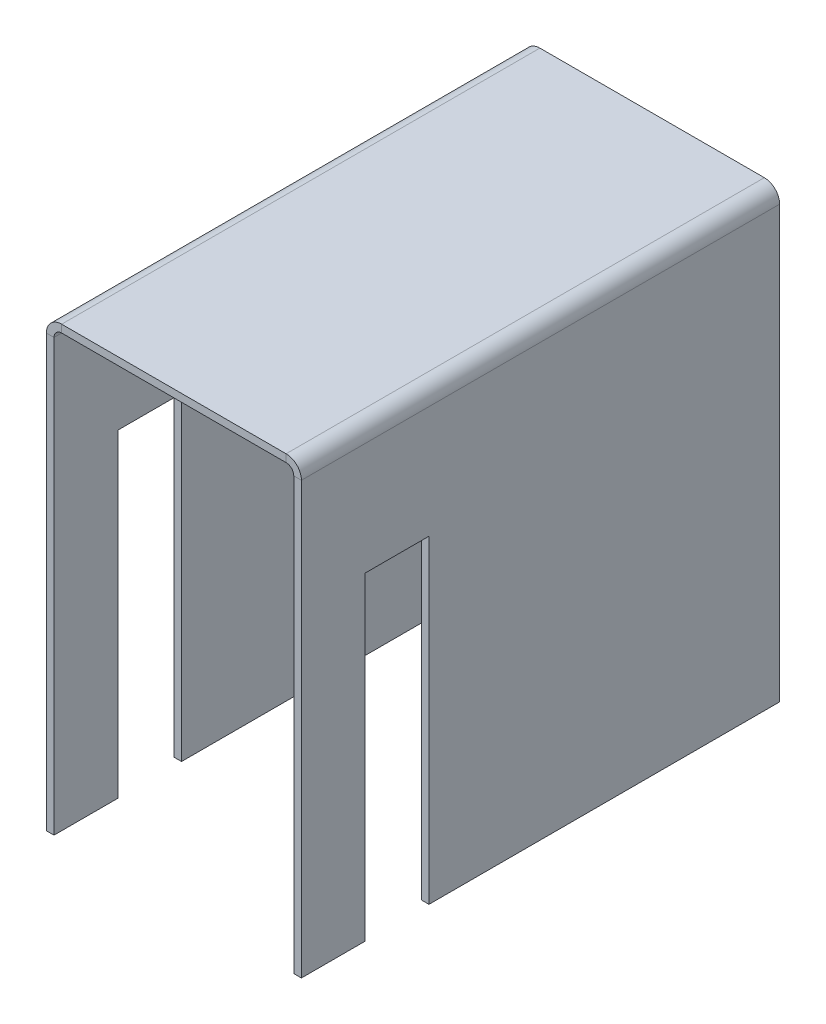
ISO-10303-21;
HEADER;
FILE_DESCRIPTION(('STEP AP214'),'2;1');
FILE_NAME('part.step','',(''),(''),'','','');
FILE_SCHEMA(('AUTOMOTIVE_DESIGN { 1 0 10303 214 1 1 1 1 }'));
ENDSEC;
DATA;
#1=APPLICATION_CONTEXT('core data for automotive mechanical design processes');
#2=APPLICATION_PROTOCOL_DEFINITION('international standard','automotive_design',2000,#1);
#3=PRODUCT_CONTEXT('',#1,'mechanical');
#4=PRODUCT('Part','Part','',(#3));
#5=PRODUCT_RELATED_PRODUCT_CATEGORY('part','',(#4));
#6=PRODUCT_DEFINITION_FORMATION('','',#4);
#7=PRODUCT_DEFINITION_CONTEXT('part definition',#1,'design');
#8=PRODUCT_DEFINITION('design','',#6,#7);
#9=PRODUCT_DEFINITION_SHAPE('','',#8);
#10=(LENGTH_UNIT() NAMED_UNIT(*) SI_UNIT(.MILLI.,.METRE.));
#11=(NAMED_UNIT(*) PLANE_ANGLE_UNIT() SI_UNIT($,.RADIAN.));
#12=(NAMED_UNIT(*) SI_UNIT($,.STERADIAN.) SOLID_ANGLE_UNIT());
#13=UNCERTAINTY_MEASURE_WITH_UNIT(LENGTH_MEASURE(1.E-05),#10,'distance_accuracy_value','');
#14=(GEOMETRIC_REPRESENTATION_CONTEXT(3) GLOBAL_UNCERTAINTY_ASSIGNED_CONTEXT((#13)) GLOBAL_UNIT_ASSIGNED_CONTEXT((#10,
#11,#12)) REPRESENTATION_CONTEXT('',''));
#15=CARTESIAN_POINT('',(0.,0.,0.));
#16=DIRECTION('',(0.,0.,1.));
#17=DIRECTION('',(1.,0.,0.));
#18=AXIS2_PLACEMENT_3D('',#15,#16,#17);
#19=CARTESIAN_POINT('',(200.,0.,375.));
#20=DIRECTION('',(0.,-1.,0.));
#21=DIRECTION('',(0.,0.,-1.));
#22=AXIS2_PLACEMENT_3D('',#19,#20,#21);
#23=PLANE('',#22);
#24=DIRECTION('',(1.,0.,0.));
#25=VECTOR('',#24,1.);
#26=CARTESIAN_POINT('',(0.,0.,275.));
#27=LINE('',#26,#25);
#28=CARTESIAN_POINT('',(194.,0.,275.));
#29=VERTEX_POINT('',#28);
#30=CARTESIAN_POINT('',(200.,0.,275.));
#31=VERTEX_POINT('',#30);
#32=EDGE_CURVE('E217',#29,#31,#27,.T.);
#33=ORIENTED_EDGE('',*,*,#32,.F.);
#34=DIRECTION('',(0.,0.,-1.));
#35=VECTOR('',#34,1.);
#36=CARTESIAN_POINT('',(194.,0.,375.));
#37=LINE('',#36,#35);
#38=CARTESIAN_POINT('',(194.,0.,1.11022302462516E-13));
#39=VERTEX_POINT('',#38);
#40=EDGE_CURVE('E377',#29,#39,#37,.T.);
#41=ORIENTED_EDGE('',*,*,#40,.T.);
#42=DIRECTION('',(-1.,0.,0.));
#43=VECTOR('',#42,1.);
#44=CARTESIAN_POINT('',(200.,0.,1.11022302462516E-13));
#45=LINE('',#44,#43);
#46=CARTESIAN_POINT('',(200.,0.,1.11022302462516E-13));
#47=VERTEX_POINT('',#46);
#48=EDGE_CURVE('E289',#47,#39,#45,.T.);
#49=ORIENTED_EDGE('',*,*,#48,.F.);
#50=DIRECTION('',(0.,0.,-1.));
#51=VECTOR('',#50,1.);
#52=CARTESIAN_POINT('',(200.,0.,375.));
#53=LINE('',#52,#51);
#54=EDGE_CURVE('E372',#31,#47,#53,.T.);
#55=ORIENTED_EDGE('',*,*,#54,.F.);
#56=EDGE_LOOP('',(#33,#41,#49,#55));
#57=FACE_BOUND('',#56,.T.);
#58=ADVANCED_FACE('F38',(#57),#23,.T.);
#59=CARTESIAN_POINT('',(6.00000000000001,0.,375.));
#60=DIRECTION('',(0.,-1.,0.));
#61=DIRECTION('',(0.,0.,-1.));
#62=AXIS2_PLACEMENT_3D('',#59,#60,#61);
#63=PLANE('',#62);
#64=CARTESIAN_POINT('',(0.,0.,275.));
#65=VERTEX_POINT('',#64);
#66=CARTESIAN_POINT('',(6.00000000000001,0.,275.));
#67=VERTEX_POINT('',#66);
#68=EDGE_CURVE('E213',#65,#67,#27,.T.);
#69=ORIENTED_EDGE('',*,*,#68,.F.);
#70=DIRECTION('',(0.,0.,-1.));
#71=VECTOR('',#70,1.);
#72=CARTESIAN_POINT('',(0.,0.,375.));
#73=LINE('',#72,#71);
#74=CARTESIAN_POINT('',(0.,0.,0.));
#75=VERTEX_POINT('',#74);
#76=EDGE_CURVE('E198',#65,#75,#73,.T.);
#77=ORIENTED_EDGE('',*,*,#76,.T.);
#78=DIRECTION('',(-1.,0.,0.));
#79=VECTOR('',#78,1.);
#80=CARTESIAN_POINT('',(6.00000000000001,0.,0.));
#81=LINE('',#80,#79);
#82=CARTESIAN_POINT('',(6.00000000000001,0.,0.));
#83=VERTEX_POINT('',#82);
#84=EDGE_CURVE('E313',#83,#75,#81,.T.);
#85=ORIENTED_EDGE('',*,*,#84,.F.);
#86=DIRECTION('',(0.,0.,-1.));
#87=VECTOR('',#86,1.);
#88=CARTESIAN_POINT('',(6.00000000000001,0.,375.));
#89=LINE('',#88,#87);
#90=EDGE_CURVE('E347',#67,#83,#89,.T.);
#91=ORIENTED_EDGE('',*,*,#90,.F.);
#92=EDGE_LOOP('',(#69,#77,#85,#91));
#93=FACE_BOUND('',#92,.T.);
#94=ADVANCED_FACE('F506',(#93),#63,.T.);
#95=CARTESIAN_POINT('',(12.,350.,375.));
#96=DIRECTION('',(0.,0.,1.));
#97=DIRECTION('',(1.,0.,0.));
#98=AXIS2_PLACEMENT_3D('',#95,#96,#97);
#99=PLANE('',#98);
#100=DIRECTION('',(0.,-1.,0.));
#101=VECTOR('',#100,1.);
#102=CARTESIAN_POINT('',(12.,350.,375.));
#103=LINE('',#102,#101);
#104=CARTESIAN_POINT('',(12.,350.,375.));
#105=VERTEX_POINT('',#104);
#106=CARTESIAN_POINT('',(12.,344.,375.));
#107=VERTEX_POINT('',#106);
#108=EDGE_CURVE('E403',#105,#107,#103,.T.);
#109=ORIENTED_EDGE('',*,*,#108,.F.);
#110=CARTESIAN_POINT('',(12.,338.,375.));
#111=DIRECTION('',(0.,0.,1.));
#112=DIRECTION('',(1.,0.,0.));
#113=AXIS2_PLACEMENT_3D('',#110,#111,#112);
#114=CIRCLE('',#113,12.);
#115=CARTESIAN_POINT('',(0.,338.,375.));
#116=VERTEX_POINT('',#115);
#117=EDGE_CURVE('E257',#116,#105,#114,.F.);
#118=ORIENTED_EDGE('',*,*,#117,.F.);
#119=DIRECTION('',(-1.,0.,0.));
#120=VECTOR('',#119,1.);
#121=CARTESIAN_POINT('',(6.00000000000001,338.,375.));
#122=LINE('',#121,#120);
#123=CARTESIAN_POINT('',(6.00000000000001,338.,375.));
#124=VERTEX_POINT('',#123);
#125=EDGE_CURVE('E400',#124,#116,#122,.T.);
#126=ORIENTED_EDGE('',*,*,#125,.F.);
#127=CARTESIAN_POINT('',(12.,338.,375.));
#128=DIRECTION('',(0.,0.,1.));
#129=DIRECTION('',(1.,0.,0.));
#130=AXIS2_PLACEMENT_3D('',#127,#128,#129);
#131=CIRCLE('',#130,6.);
#132=EDGE_CURVE('E273',#124,#107,#131,.F.);
#133=ORIENTED_EDGE('',*,*,#132,.T.);
#134=EDGE_LOOP('',(#109,#118,#126,#133));
#135=FACE_BOUND('',#134,.T.);
#136=ADVANCED_FACE('F40',(#135),#99,.T.);
#137=CARTESIAN_POINT('',(6.00000000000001,338.,375.));
#138=DIRECTION('',(0.,0.,1.));
#139=DIRECTION('',(1.,0.,0.));
#140=AXIS2_PLACEMENT_3D('',#137,#138,#139);
#141=PLANE('',#140);
#142=DIRECTION('',(1.,0.,0.));
#143=VECTOR('',#142,1.);
#144=CARTESIAN_POINT('',(0.,350.,375.));
#145=LINE('',#144,#143);
#146=CARTESIAN_POINT('',(188.,350.,375.));
#147=VERTEX_POINT('',#146);
#148=EDGE_CURVE('E253',#105,#147,#145,.T.);
#149=ORIENTED_EDGE('',*,*,#148,.F.);
#150=ORIENTED_EDGE('',*,*,#108,.T.);
#151=DIRECTION('',(1.,0.,0.));
#152=VECTOR('',#151,1.);
#153=CARTESIAN_POINT('',(0.,344.,375.));
#154=LINE('',#153,#152);
#155=CARTESIAN_POINT('',(188.,344.,375.));
#156=VERTEX_POINT('',#155);
#157=EDGE_CURVE('E277',#107,#156,#154,.T.);
#158=ORIENTED_EDGE('',*,*,#157,.T.);
#159=DIRECTION('',(0.,1.,0.));
#160=VECTOR('',#159,1.);
#161=CARTESIAN_POINT('',(188.,344.,375.));
#162=LINE('',#161,#160);
#163=EDGE_CURVE('E388',#156,#147,#162,.T.);
#164=ORIENTED_EDGE('',*,*,#163,.T.);
#165=EDGE_LOOP('',(#149,#150,#158,#164));
#166=FACE_BOUND('',#165,.T.);
#167=ADVANCED_FACE('F437',(#166),#141,.T.);
#168=CARTESIAN_POINT('',(-2.22044604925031E-13,338.,0.));
#169=DIRECTION('',(0.,0.,-1.));
#170=DIRECTION('',(-1.,0.,0.));
#171=AXIS2_PLACEMENT_3D('',#168,#169,#170);
#172=PLANE('',#171);
#173=DIRECTION('',(1.,0.,0.));
#174=VECTOR('',#173,1.);
#175=CARTESIAN_POINT('',(-2.22044604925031E-13,338.,0.));
#176=LINE('',#175,#174);
#177=CARTESIAN_POINT('',(-2.22044604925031E-13,338.,0.));
#178=VERTEX_POINT('',#177);
#179=CARTESIAN_POINT('',(5.99999999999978,338.,0.));
#180=VERTEX_POINT('',#179);
#181=EDGE_CURVE('E397',#178,#180,#176,.T.);
#182=ORIENTED_EDGE('',*,*,#181,.F.);
#183=CARTESIAN_POINT('',(11.9999999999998,338.,0.));
#184=DIRECTION('',(0.,0.,1.));
#185=DIRECTION('',(1.,0.,0.));
#186=AXIS2_PLACEMENT_3D('',#183,#184,#185);
#187=CIRCLE('',#186,12.);
#188=CARTESIAN_POINT('',(11.9999999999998,350.,0.));
#189=VERTEX_POINT('',#188);
#190=EDGE_CURVE('E305',#178,#189,#187,.F.);
#191=ORIENTED_EDGE('',*,*,#190,.T.);
#192=DIRECTION('',(0.,1.,0.));
#193=VECTOR('',#192,1.);
#194=CARTESIAN_POINT('',(11.9999999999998,344.,0.));
#195=LINE('',#194,#193);
#196=CARTESIAN_POINT('',(11.9999999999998,344.,0.));
#197=VERTEX_POINT('',#196);
#198=EDGE_CURVE('E394',#197,#189,#195,.T.);
#199=ORIENTED_EDGE('',*,*,#198,.F.);
#200=CARTESIAN_POINT('',(11.9999999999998,338.,0.));
#201=DIRECTION('',(0.,0.,1.));
#202=DIRECTION('',(1.,0.,0.));
#203=AXIS2_PLACEMENT_3D('',#200,#201,#202);
#204=CIRCLE('',#203,6.);
#205=EDGE_CURVE('E321',#180,#197,#204,.F.);
#206=ORIENTED_EDGE('',*,*,#205,.F.);
#207=EDGE_LOOP('',(#182,#191,#199,#206));
#208=FACE_BOUND('',#207,.T.);
#209=ADVANCED_FACE('F497',(#208),#172,.T.);
#210=CARTESIAN_POINT('',(11.9999999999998,344.,0.));
#211=DIRECTION('',(0.,0.,-1.));
#212=DIRECTION('',(-1.,0.,0.));
#213=AXIS2_PLACEMENT_3D('',#210,#211,#212);
#214=PLANE('',#213);
#215=DIRECTION('',(0.,1.,0.));
#216=VECTOR('',#215,1.);
#217=CARTESIAN_POINT('',(0.,0.,0.));
#218=LINE('',#217,#216);
#219=EDGE_CURVE('E309',#75,#178,#218,.T.);
#220=ORIENTED_EDGE('',*,*,#219,.T.);
#221=ORIENTED_EDGE('',*,*,#181,.T.);
#222=DIRECTION('',(0.,1.,0.));
#223=VECTOR('',#222,1.);
#224=CARTESIAN_POINT('',(6.00000000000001,0.,0.));
#225=LINE('',#224,#223);
#226=EDGE_CURVE('E317',#83,#180,#225,.T.);
#227=ORIENTED_EDGE('',*,*,#226,.F.);
#228=ORIENTED_EDGE('',*,*,#84,.T.);
#229=EDGE_LOOP('',(#220,#221,#227,#228));
#230=FACE_BOUND('',#229,.T.);
#231=ADVANCED_FACE('F504',(#230),#214,.T.);
#232=CARTESIAN_POINT('',(200.,338.,375.));
#233=DIRECTION('',(0.,0.,1.));
#234=DIRECTION('',(1.,0.,0.));
#235=AXIS2_PLACEMENT_3D('',#232,#233,#234);
#236=PLANE('',#235);
#237=DIRECTION('',(-1.,0.,0.));
#238=VECTOR('',#237,1.);
#239=CARTESIAN_POINT('',(200.,338.,375.));
#240=LINE('',#239,#238);
#241=CARTESIAN_POINT('',(200.,338.,375.));
#242=VERTEX_POINT('',#241);
#243=CARTESIAN_POINT('',(194.,338.,375.));
#244=VERTEX_POINT('',#243);
#245=EDGE_CURVE('E391',#242,#244,#240,.T.);
#246=ORIENTED_EDGE('',*,*,#245,.F.);
#247=CARTESIAN_POINT('',(188.,338.,375.));
#248=DIRECTION('',(0.,0.,1.));
#249=DIRECTION('',(1.,0.,0.));
#250=AXIS2_PLACEMENT_3D('',#247,#248,#249);
#251=CIRCLE('',#250,12.);
#252=EDGE_CURVE('E249',#147,#242,#251,.F.);
#253=ORIENTED_EDGE('',*,*,#252,.F.);
#254=ORIENTED_EDGE('',*,*,#163,.F.);
#255=CARTESIAN_POINT('',(188.,338.,375.));
#256=DIRECTION('',(0.,0.,1.));
#257=DIRECTION('',(1.,0.,0.));
#258=AXIS2_PLACEMENT_3D('',#255,#256,#257);
#259=CIRCLE('',#258,6.);
#260=EDGE_CURVE('E281',#156,#244,#259,.F.);
#261=ORIENTED_EDGE('',*,*,#260,.T.);
#262=EDGE_LOOP('',(#246,#253,#254,#261));
#263=FACE_BOUND('',#262,.T.);
#264=ADVANCED_FACE('F446',(#263),#236,.T.);
#265=CARTESIAN_POINT('',(188.,344.,375.));
#266=DIRECTION('',(0.,0.,1.));
#267=DIRECTION('',(1.,0.,0.));
#268=AXIS2_PLACEMENT_3D('',#265,#266,#267);
#269=PLANE('',#268);
#270=DIRECTION('',(0.,-1.,0.));
#271=VECTOR('',#270,1.);
#272=CARTESIAN_POINT('',(200.,350.,375.));
#273=LINE('',#272,#271);
#274=CARTESIAN_POINT('',(200.,0.,375.));
#275=VERTEX_POINT('',#274);
#276=EDGE_CURVE('E245',#242,#275,#273,.T.);
#277=ORIENTED_EDGE('',*,*,#276,.F.);
#278=ORIENTED_EDGE('',*,*,#245,.T.);
#279=DIRECTION('',(0.,-1.,0.));
#280=VECTOR('',#279,1.);
#281=CARTESIAN_POINT('',(194.,350.,375.));
#282=LINE('',#281,#280);
#283=CARTESIAN_POINT('',(194.,0.,375.));
#284=VERTEX_POINT('',#283);
#285=EDGE_CURVE('E237',#244,#284,#282,.T.);
#286=ORIENTED_EDGE('',*,*,#285,.T.);
#287=DIRECTION('',(-1.,0.,0.));
#288=VECTOR('',#287,1.);
#289=CARTESIAN_POINT('',(200.,0.,375.));
#290=LINE('',#289,#288);
#291=EDGE_CURVE('E240',#275,#284,#290,.T.);
#292=ORIENTED_EDGE('',*,*,#291,.F.);
#293=EDGE_LOOP('',(#277,#278,#286,#292));
#294=FACE_BOUND('',#293,.T.);
#295=ADVANCED_FACE('F456',(#294),#269,.T.);
#296=CARTESIAN_POINT('',(188.,350.,1.11022302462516E-13));
#297=DIRECTION('',(0.,0.,-1.));
#298=DIRECTION('',(-1.,0.,0.));
#299=AXIS2_PLACEMENT_3D('',#296,#297,#298);
#300=PLANE('',#299);
#301=DIRECTION('',(0.,-1.,0.));
#302=VECTOR('',#301,1.);
#303=CARTESIAN_POINT('',(188.,350.,1.11022302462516E-13));
#304=LINE('',#303,#302);
#305=CARTESIAN_POINT('',(188.,350.,1.11022302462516E-13));
#306=VERTEX_POINT('',#305);
#307=CARTESIAN_POINT('',(188.,344.,1.11022302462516E-13));
#308=VERTEX_POINT('',#307);
#309=EDGE_CURVE('E385',#306,#308,#304,.T.);
#310=ORIENTED_EDGE('',*,*,#309,.F.);
#311=CARTESIAN_POINT('',(188.,338.,1.11022302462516E-13));
#312=DIRECTION('',(0.,0.,1.));
#313=DIRECTION('',(1.,0.,0.));
#314=AXIS2_PLACEMENT_3D('',#311,#312,#313);
#315=CIRCLE('',#314,12.);
#316=CARTESIAN_POINT('',(200.,338.,0.));
#317=VERTEX_POINT('',#316);
#318=EDGE_CURVE('E297',#306,#317,#315,.F.);
#319=ORIENTED_EDGE('',*,*,#318,.T.);
#320=DIRECTION('',(1.,0.,0.));
#321=VECTOR('',#320,1.);
#322=CARTESIAN_POINT('',(194.,338.,1.11022302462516E-13));
#323=LINE('',#322,#321);
#324=CARTESIAN_POINT('',(194.,338.,1.11022302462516E-13));
#325=VERTEX_POINT('',#324);
#326=EDGE_CURVE('E382',#325,#317,#323,.T.);
#327=ORIENTED_EDGE('',*,*,#326,.F.);
#328=CARTESIAN_POINT('',(188.,338.,1.11022302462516E-13));
#329=DIRECTION('',(0.,0.,1.));
#330=DIRECTION('',(1.,0.,0.));
#331=AXIS2_PLACEMENT_3D('',#328,#329,#330);
#332=CIRCLE('',#331,6.);
#333=EDGE_CURVE('E241',#308,#325,#332,.F.);
#334=ORIENTED_EDGE('',*,*,#333,.F.);
#335=EDGE_LOOP('',(#310,#319,#327,#334));
#336=FACE_BOUND('',#335,.T.);
#337=ADVANCED_FACE('F487',(#336),#300,.T.);
#338=CARTESIAN_POINT('',(194.,338.,1.11022302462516E-13));
#339=DIRECTION('',(0.,0.,-1.));
#340=DIRECTION('',(-1.,0.,0.));
#341=AXIS2_PLACEMENT_3D('',#338,#339,#340);
#342=PLANE('',#341);
#343=DIRECTION('',(1.,0.,0.));
#344=VECTOR('',#343,1.);
#345=CARTESIAN_POINT('',(-2.22044604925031E-13,350.,0.));
#346=LINE('',#345,#344);
#347=EDGE_CURVE('E301',#189,#306,#346,.T.);
#348=ORIENTED_EDGE('',*,*,#347,.T.);
#349=ORIENTED_EDGE('',*,*,#309,.T.);
#350=DIRECTION('',(1.,0.,0.));
#351=VECTOR('',#350,1.);
#352=CARTESIAN_POINT('',(-2.22044604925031E-13,344.,0.));
#353=LINE('',#352,#351);
#354=EDGE_CURVE('E325',#197,#308,#353,.T.);
#355=ORIENTED_EDGE('',*,*,#354,.F.);
#356=ORIENTED_EDGE('',*,*,#198,.T.);
#357=EDGE_LOOP('',(#348,#349,#355,#356));
#358=FACE_BOUND('',#357,.T.);
#359=ADVANCED_FACE('F494',(#358),#342,.T.);
#360=CARTESIAN_POINT('',(194.,350.,375.));
#361=DIRECTION('',(1.,0.,0.));
#362=DIRECTION('',(0.,1.,0.));
#363=AXIS2_PLACEMENT_3D('',#360,#361,#362);
#364=PLANE('',#363);
#365=ORIENTED_EDGE('',*,*,#40,.F.);
#366=DIRECTION('',(0.,1.,0.));
#367=VECTOR('',#366,1.);
#368=CARTESIAN_POINT('',(194.,350.,275.));
#369=LINE('',#368,#367);
#370=CARTESIAN_POINT('',(194.,250.,275.));
#371=VERTEX_POINT('',#370);
#372=EDGE_CURVE('E232',#29,#371,#369,.T.);
#373=ORIENTED_EDGE('',*,*,#372,.T.);
#374=DIRECTION('',(0.,0.,1.));
#375=VECTOR('',#374,1.);
#376=CARTESIAN_POINT('',(194.,250.,375.));
#377=LINE('',#376,#375);
#378=CARTESIAN_POINT('',(194.,250.,325.));
#379=VERTEX_POINT('',#378);
#380=EDGE_CURVE('E216',#371,#379,#377,.T.);
#381=ORIENTED_EDGE('',*,*,#380,.T.);
#382=DIRECTION('',(0.,-1.,0.));
#383=VECTOR('',#382,1.);
#384=CARTESIAN_POINT('',(194.,350.,325.));
#385=LINE('',#384,#383);
#386=CARTESIAN_POINT('',(194.,0.,325.));
#387=VERTEX_POINT('',#386);
#388=EDGE_CURVE('E228',#379,#387,#385,.T.);
#389=ORIENTED_EDGE('',*,*,#388,.T.);
#390=EDGE_CURVE('E378',#284,#387,#37,.T.);
#391=ORIENTED_EDGE('',*,*,#390,.F.);
#392=ORIENTED_EDGE('',*,*,#285,.F.);
#393=DIRECTION('',(0.,0.,-1.));
#394=VECTOR('',#393,1.);
#395=CARTESIAN_POINT('',(194.,338.,375.));
#396=LINE('',#395,#394);
#397=EDGE_CURVE('E285',#244,#325,#396,.T.);
#398=ORIENTED_EDGE('',*,*,#397,.T.);
#399=DIRECTION('',(0.,-1.,0.));
#400=VECTOR('',#399,1.);
#401=CARTESIAN_POINT('',(194.,350.,1.11022302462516E-13));
#402=LINE('',#401,#400);
#403=EDGE_CURVE('E236',#325,#39,#402,.T.);
#404=ORIENTED_EDGE('',*,*,#403,.T.);
#405=EDGE_LOOP('',(#365,#373,#381,#389,#391,#392,#398,#404));
#406=FACE_BOUND('',#405,.T.);
#407=ADVANCED_FACE('F482',(#406),#364,.F.);
#408=DIRECTION('',(1.,0.,0.));
#409=VECTOR('',#408,1.);
#410=CARTESIAN_POINT('',(0.,0.,325.));
#411=LINE('',#410,#409);
#412=CARTESIAN_POINT('',(200.,0.,325.));
#413=VERTEX_POINT('',#412);
#414=EDGE_CURVE('E222',#387,#413,#411,.T.);
#415=ORIENTED_EDGE('',*,*,#414,.T.);
#416=EDGE_CURVE('E373',#275,#413,#53,.T.);
#417=ORIENTED_EDGE('',*,*,#416,.F.);
#418=ORIENTED_EDGE('',*,*,#291,.T.);
#419=ORIENTED_EDGE('',*,*,#390,.T.);
#420=EDGE_LOOP('',(#415,#417,#418,#419));
#421=FACE_BOUND('',#420,.T.);
#422=ADVANCED_FACE('F461',(#421),#23,.T.);
#423=CARTESIAN_POINT('',(200.,350.,375.));
#424=DIRECTION('',(1.,0.,0.));
#425=DIRECTION('',(0.,1.,0.));
#426=AXIS2_PLACEMENT_3D('',#423,#424,#425);
#427=PLANE('',#426);
#428=DIRECTION('',(0.,1.,0.));
#429=VECTOR('',#428,1.);
#430=CARTESIAN_POINT('',(200.,250.,275.));
#431=LINE('',#430,#429);
#432=CARTESIAN_POINT('',(200.,250.,275.));
#433=VERTEX_POINT('',#432);
#434=EDGE_CURVE('E54',#31,#433,#431,.T.);
#435=ORIENTED_EDGE('',*,*,#434,.F.);
#436=ORIENTED_EDGE('',*,*,#54,.T.);
#437=DIRECTION('',(0.,-1.,0.));
#438=VECTOR('',#437,1.);
#439=CARTESIAN_POINT('',(200.,350.,0.));
#440=LINE('',#439,#438);
#441=EDGE_CURVE('E293',#317,#47,#440,.T.);
#442=ORIENTED_EDGE('',*,*,#441,.F.);
#443=DIRECTION('',(0.,0.,-1.));
#444=VECTOR('',#443,1.);
#445=CARTESIAN_POINT('',(200.,338.,375.));
#446=LINE('',#445,#444);
#447=EDGE_CURVE('E368',#242,#317,#446,.T.);
#448=ORIENTED_EDGE('',*,*,#447,.F.);
#449=ORIENTED_EDGE('',*,*,#276,.T.);
#450=ORIENTED_EDGE('',*,*,#416,.T.);
#451=DIRECTION('',(0.,-1.,0.));
#452=VECTOR('',#451,1.);
#453=CARTESIAN_POINT('',(200.,250.,325.));
#454=LINE('',#453,#452);
#455=CARTESIAN_POINT('',(200.,250.,325.));
#456=VERTEX_POINT('',#455);
#457=EDGE_CURVE('E200',#456,#413,#454,.T.);
#458=ORIENTED_EDGE('',*,*,#457,.F.);
#459=DIRECTION('',(0.,0.,1.));
#460=VECTOR('',#459,1.);
#461=CARTESIAN_POINT('',(200.,250.,275.));
#462=LINE('',#461,#460);
#463=EDGE_CURVE('E203',#433,#456,#462,.T.);
#464=ORIENTED_EDGE('',*,*,#463,.F.);
#465=EDGE_LOOP('',(#435,#436,#442,#448,#449,#450,#458,#464));
#466=FACE_BOUND('',#465,.T.);
#467=ADVANCED_FACE('F454',(#466),#427,.T.);
#468=CARTESIAN_POINT('',(188.,338.,375.));
#469=DIRECTION('',(0.,0.,-1.));
#470=DIRECTION('',(-1.,0.,0.));
#471=AXIS2_PLACEMENT_3D('',#468,#469,#470);
#472=CYLINDRICAL_SURFACE('',#471,12.);
#473=ORIENTED_EDGE('',*,*,#318,.F.);
#474=DIRECTION('',(0.,0.,-1.));
#475=VECTOR('',#474,1.);
#476=CARTESIAN_POINT('',(188.,350.,375.));
#477=LINE('',#476,#475);
#478=EDGE_CURVE('E364',#147,#306,#477,.T.);
#479=ORIENTED_EDGE('',*,*,#478,.F.);
#480=ORIENTED_EDGE('',*,*,#252,.T.);
#481=ORIENTED_EDGE('',*,*,#447,.T.);
#482=EDGE_LOOP('',(#473,#479,#480,#481));
#483=FACE_BOUND('',#482,.T.);
#484=ADVANCED_FACE('F445',(#483),#472,.T.);
#485=CARTESIAN_POINT('',(0.,350.,375.));
#486=DIRECTION('',(0.,1.,0.));
#487=DIRECTION('',(0.,0.,1.));
#488=AXIS2_PLACEMENT_3D('',#485,#486,#487);
#489=PLANE('',#488);
#490=ORIENTED_EDGE('',*,*,#347,.F.);
#491=DIRECTION('',(0.,0.,-1.));
#492=VECTOR('',#491,1.);
#493=CARTESIAN_POINT('',(12.,350.,375.));
#494=LINE('',#493,#492);
#495=EDGE_CURVE('E360',#105,#189,#494,.T.);
#496=ORIENTED_EDGE('',*,*,#495,.F.);
#497=ORIENTED_EDGE('',*,*,#148,.T.);
#498=ORIENTED_EDGE('',*,*,#478,.T.);
#499=EDGE_LOOP('',(#490,#496,#497,#498));
#500=FACE_BOUND('',#499,.T.);
#501=ADVANCED_FACE('F436',(#500),#489,.T.);
#502=CARTESIAN_POINT('',(12.,338.,375.));
#503=DIRECTION('',(0.,0.,-1.));
#504=DIRECTION('',(-1.,0.,0.));
#505=AXIS2_PLACEMENT_3D('',#502,#503,#504);
#506=CYLINDRICAL_SURFACE('',#505,12.);
#507=ORIENTED_EDGE('',*,*,#190,.F.);
#508=DIRECTION('',(0.,0.,-1.));
#509=VECTOR('',#508,1.);
#510=CARTESIAN_POINT('',(0.,338.,375.));
#511=LINE('',#510,#509);
#512=EDGE_CURVE('E356',#116,#178,#511,.T.);
#513=ORIENTED_EDGE('',*,*,#512,.F.);
#514=ORIENTED_EDGE('',*,*,#117,.T.);
#515=ORIENTED_EDGE('',*,*,#495,.T.);
#516=EDGE_LOOP('',(#507,#513,#514,#515));
#517=FACE_BOUND('',#516,.T.);
#518=ADVANCED_FACE('F428',(#517),#506,.T.);
#519=CARTESIAN_POINT('',(0.,0.,375.));
#520=DIRECTION('',(-1.,0.,0.));
#521=DIRECTION('',(0.,0.,1.));
#522=AXIS2_PLACEMENT_3D('',#519,#520,#521);
#523=PLANE('',#522);
#524=DIRECTION('',(0.,1.,0.));
#525=VECTOR('',#524,1.);
#526=CARTESIAN_POINT('',(-2.22044604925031E-13,250.,275.));
#527=LINE('',#526,#525);
#528=CARTESIAN_POINT('',(-2.22044604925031E-13,250.,275.));
#529=VERTEX_POINT('',#528);
#530=EDGE_CURVE('E177',#65,#529,#527,.T.);
#531=ORIENTED_EDGE('',*,*,#530,.T.);
#532=DIRECTION('',(0.,0.,1.));
#533=VECTOR('',#532,1.);
#534=CARTESIAN_POINT('',(-2.22044604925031E-13,250.,275.));
#535=LINE('',#534,#533);
#536=CARTESIAN_POINT('',(-1.11022302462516E-13,250.,325.));
#537=VERTEX_POINT('',#536);
#538=EDGE_CURVE('E185',#529,#537,#535,.T.);
#539=ORIENTED_EDGE('',*,*,#538,.T.);
#540=DIRECTION('',(0.,-1.,0.));
#541=VECTOR('',#540,1.);
#542=CARTESIAN_POINT('',(-1.11022302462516E-13,250.,325.));
#543=LINE('',#542,#541);
#544=CARTESIAN_POINT('',(0.,0.,325.));
#545=VERTEX_POINT('',#544);
#546=EDGE_CURVE('E193',#537,#545,#543,.T.);
#547=ORIENTED_EDGE('',*,*,#546,.T.);
#548=CARTESIAN_POINT('',(0.,0.,375.));
#549=VERTEX_POINT('',#548);
#550=EDGE_CURVE('E352',#549,#545,#73,.T.);
#551=ORIENTED_EDGE('',*,*,#550,.F.);
#552=DIRECTION('',(0.,1.,0.));
#553=VECTOR('',#552,1.);
#554=CARTESIAN_POINT('',(0.,0.,375.));
#555=LINE('',#554,#553);
#556=EDGE_CURVE('E261',#549,#116,#555,.T.);
#557=ORIENTED_EDGE('',*,*,#556,.T.);
#558=ORIENTED_EDGE('',*,*,#512,.T.);
#559=ORIENTED_EDGE('',*,*,#219,.F.);
#560=ORIENTED_EDGE('',*,*,#76,.F.);
#561=EDGE_LOOP('',(#531,#539,#547,#551,#557,#558,#559,#560));
#562=FACE_BOUND('',#561,.T.);
#563=ADVANCED_FACE('F196',(#562),#523,.T.);
#564=CARTESIAN_POINT('',(6.00000000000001,0.,325.));
#565=VERTEX_POINT('',#564);
#566=EDGE_CURVE('E218',#545,#565,#411,.T.);
#567=ORIENTED_EDGE('',*,*,#566,.T.);
#568=CARTESIAN_POINT('',(6.00000000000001,0.,375.));
#569=VERTEX_POINT('',#568);
#570=EDGE_CURVE('E348',#569,#565,#89,.T.);
#571=ORIENTED_EDGE('',*,*,#570,.F.);
#572=DIRECTION('',(-1.,0.,0.));
#573=VECTOR('',#572,1.);
#574=CARTESIAN_POINT('',(6.00000000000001,0.,375.));
#575=LINE('',#574,#573);
#576=EDGE_CURVE('E265',#569,#549,#575,.T.);
#577=ORIENTED_EDGE('',*,*,#576,.T.);
#578=ORIENTED_EDGE('',*,*,#550,.T.);
#579=EDGE_LOOP('',(#567,#571,#577,#578));
#580=FACE_BOUND('',#579,.T.);
#581=ADVANCED_FACE('F417',(#580),#63,.T.);
#582=CARTESIAN_POINT('',(6.00000000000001,0.,375.));
#583=DIRECTION('',(-1.,0.,0.));
#584=DIRECTION('',(0.,0.,1.));
#585=AXIS2_PLACEMENT_3D('',#582,#583,#584);
#586=PLANE('',#585);
#587=DIRECTION('',(0.,0.,-1.));
#588=VECTOR('',#587,1.);
#589=CARTESIAN_POINT('',(6.00000000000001,250.,375.));
#590=LINE('',#589,#588);
#591=CARTESIAN_POINT('',(5.99999999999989,250.,325.));
#592=VERTEX_POINT('',#591);
#593=CARTESIAN_POINT('',(5.99999999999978,250.,275.));
#594=VERTEX_POINT('',#593);
#595=EDGE_CURVE('E406',#592,#594,#590,.T.);
#596=ORIENTED_EDGE('',*,*,#595,.T.);
#597=DIRECTION('',(0.,-1.,0.));
#598=VECTOR('',#597,1.);
#599=CARTESIAN_POINT('',(6.00000000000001,0.,275.));
#600=LINE('',#599,#598);
#601=EDGE_CURVE('E11',#594,#67,#600,.T.);
#602=ORIENTED_EDGE('',*,*,#601,.T.);
#603=ORIENTED_EDGE('',*,*,#90,.T.);
#604=ORIENTED_EDGE('',*,*,#226,.T.);
#605=DIRECTION('',(0.,0.,-1.));
#606=VECTOR('',#605,1.);
#607=CARTESIAN_POINT('',(6.00000000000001,338.,375.));
#608=LINE('',#607,#606);
#609=EDGE_CURVE('E343',#124,#180,#608,.T.);
#610=ORIENTED_EDGE('',*,*,#609,.F.);
#611=DIRECTION('',(0.,1.,0.));
#612=VECTOR('',#611,1.);
#613=CARTESIAN_POINT('',(6.00000000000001,0.,375.));
#614=LINE('',#613,#612);
#615=EDGE_CURVE('E269',#569,#124,#614,.T.);
#616=ORIENTED_EDGE('',*,*,#615,.F.);
#617=ORIENTED_EDGE('',*,*,#570,.T.);
#618=DIRECTION('',(0.,1.,0.));
#619=VECTOR('',#618,1.);
#620=CARTESIAN_POINT('',(6.00000000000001,0.,325.));
#621=LINE('',#620,#619);
#622=EDGE_CURVE('E47',#565,#592,#621,.T.);
#623=ORIENTED_EDGE('',*,*,#622,.T.);
#624=EDGE_LOOP('',(#596,#602,#603,#604,#610,#616,#617,#623));
#625=FACE_BOUND('',#624,.T.);
#626=ADVANCED_FACE('F412',(#625),#586,.F.);
#627=CARTESIAN_POINT('',(12.,338.,375.));
#628=DIRECTION('',(0.,0.,-1.));
#629=DIRECTION('',(-1.,0.,0.));
#630=AXIS2_PLACEMENT_3D('',#627,#628,#629);
#631=CYLINDRICAL_SURFACE('',#630,6.);
#632=ORIENTED_EDGE('',*,*,#205,.T.);
#633=DIRECTION('',(0.,0.,-1.));
#634=VECTOR('',#633,1.);
#635=CARTESIAN_POINT('',(12.,344.,375.));
#636=LINE('',#635,#634);
#637=EDGE_CURVE('E339',#107,#197,#636,.T.);
#638=ORIENTED_EDGE('',*,*,#637,.F.);
#639=ORIENTED_EDGE('',*,*,#132,.F.);
#640=ORIENTED_EDGE('',*,*,#609,.T.);
#641=EDGE_LOOP('',(#632,#638,#639,#640));
#642=FACE_BOUND('',#641,.T.);
#643=ADVANCED_FACE('F499',(#642),#631,.F.);
#644=CARTESIAN_POINT('',(0.,344.,375.));
#645=DIRECTION('',(0.,1.,0.));
#646=DIRECTION('',(0.,0.,1.));
#647=AXIS2_PLACEMENT_3D('',#644,#645,#646);
#648=PLANE('',#647);
#649=ORIENTED_EDGE('',*,*,#354,.T.);
#650=DIRECTION('',(0.,0.,-1.));
#651=VECTOR('',#650,1.);
#652=CARTESIAN_POINT('',(188.,344.,375.));
#653=LINE('',#652,#651);
#654=EDGE_CURVE('E335',#156,#308,#653,.T.);
#655=ORIENTED_EDGE('',*,*,#654,.F.);
#656=ORIENTED_EDGE('',*,*,#157,.F.);
#657=ORIENTED_EDGE('',*,*,#637,.T.);
#658=EDGE_LOOP('',(#649,#655,#656,#657));
#659=FACE_BOUND('',#658,.T.);
#660=ADVANCED_FACE('F491',(#659),#648,.F.);
#661=CARTESIAN_POINT('',(188.,338.,375.));
#662=DIRECTION('',(0.,0.,-1.));
#663=DIRECTION('',(-1.,0.,0.));
#664=AXIS2_PLACEMENT_3D('',#661,#662,#663);
#665=CYLINDRICAL_SURFACE('',#664,6.);
#666=ORIENTED_EDGE('',*,*,#333,.T.);
#667=ORIENTED_EDGE('',*,*,#397,.F.);
#668=ORIENTED_EDGE('',*,*,#260,.F.);
#669=ORIENTED_EDGE('',*,*,#654,.T.);
#670=EDGE_LOOP('',(#666,#667,#668,#669));
#671=FACE_BOUND('',#670,.T.);
#672=ADVANCED_FACE('F489',(#671),#665,.F.);
#673=CARTESIAN_POINT('',(188.,338.,375.));
#674=DIRECTION('',(0.,0.,1.));
#675=DIRECTION('',(1.,0.,0.));
#676=AXIS2_PLACEMENT_3D('',#673,#674,#675);
#677=PLANE('',#676);
#678=ORIENTED_EDGE('',*,*,#615,.T.);
#679=ORIENTED_EDGE('',*,*,#125,.T.);
#680=ORIENTED_EDGE('',*,*,#556,.F.);
#681=ORIENTED_EDGE('',*,*,#576,.F.);
#682=EDGE_LOOP('',(#678,#679,#680,#681));
#683=FACE_BOUND('',#682,.T.);
#684=ADVANCED_FACE('F421',(#683),#677,.T.);
#685=CARTESIAN_POINT('',(188.,338.,1.11022302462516E-13));
#686=DIRECTION('',(0.,0.,1.));
#687=DIRECTION('',(1.,0.,0.));
#688=AXIS2_PLACEMENT_3D('',#685,#686,#687);
#689=PLANE('',#688);
#690=ORIENTED_EDGE('',*,*,#403,.F.);
#691=ORIENTED_EDGE('',*,*,#326,.T.);
#692=ORIENTED_EDGE('',*,*,#441,.T.);
#693=ORIENTED_EDGE('',*,*,#48,.T.);
#694=EDGE_LOOP('',(#690,#691,#692,#693));
#695=FACE_BOUND('',#694,.T.);
#696=ADVANCED_FACE('F484',(#695),#689,.F.);
#697=CARTESIAN_POINT('',(-2.22044604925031E-13,250.,275.));
#698=DIRECTION('',(0.,1.,0.));
#699=DIRECTION('',(-1.,0.,0.));
#700=AXIS2_PLACEMENT_3D('',#697,#698,#699);
#701=PLANE('',#700);
#702=DIRECTION('',(1.,0.,0.));
#703=VECTOR('',#702,1.);
#704=CARTESIAN_POINT('',(-1.11022302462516E-13,250.,325.));
#705=LINE('',#704,#703);
#706=EDGE_CURVE('E188',#537,#592,#705,.T.);
#707=ORIENTED_EDGE('',*,*,#706,.F.);
#708=ORIENTED_EDGE('',*,*,#538,.F.);
#709=DIRECTION('',(1.,0.,0.));
#710=VECTOR('',#709,1.);
#711=CARTESIAN_POINT('',(-2.22044604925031E-13,250.,275.));
#712=LINE('',#711,#710);
#713=EDGE_CURVE('E62',#529,#594,#712,.T.);
#714=ORIENTED_EDGE('',*,*,#713,.T.);
#715=ORIENTED_EDGE('',*,*,#595,.F.);
#716=EDGE_LOOP('',(#707,#708,#714,#715));
#717=FACE_BOUND('',#716,.T.);
#718=ADVANCED_FACE('F186',(#717),#701,.F.);
#719=CARTESIAN_POINT('',(-1.11022302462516E-13,250.,325.));
#720=DIRECTION('',(0.,0.,1.));
#721=DIRECTION('',(1.,0.,0.));
#722=AXIS2_PLACEMENT_3D('',#719,#720,#721);
#723=PLANE('',#722);
#724=ORIENTED_EDGE('',*,*,#566,.F.);
#725=ORIENTED_EDGE('',*,*,#546,.F.);
#726=ORIENTED_EDGE('',*,*,#706,.T.);
#727=ORIENTED_EDGE('',*,*,#622,.F.);
#728=EDGE_LOOP('',(#724,#725,#726,#727));
#729=FACE_BOUND('',#728,.T.);
#730=ADVANCED_FACE('F415',(#729),#723,.F.);
#731=CARTESIAN_POINT('',(-2.22044604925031E-13,250.,275.));
#732=DIRECTION('',(0.,0.,-1.));
#733=DIRECTION('',(-1.,0.,0.));
#734=AXIS2_PLACEMENT_3D('',#731,#732,#733);
#735=PLANE('',#734);
#736=ORIENTED_EDGE('',*,*,#713,.F.);
#737=ORIENTED_EDGE('',*,*,#530,.F.);
#738=ORIENTED_EDGE('',*,*,#68,.T.);
#739=ORIENTED_EDGE('',*,*,#601,.F.);
#740=EDGE_LOOP('',(#736,#737,#738,#739));
#741=FACE_BOUND('',#740,.T.);
#742=ADVANCED_FACE('F175',(#741),#735,.F.);
#743=ORIENTED_EDGE('',*,*,#32,.T.);
#744=ORIENTED_EDGE('',*,*,#434,.T.);
#745=EDGE_CURVE('E182',#371,#433,#712,.T.);
#746=ORIENTED_EDGE('',*,*,#745,.F.);
#747=ORIENTED_EDGE('',*,*,#372,.F.);
#748=EDGE_LOOP('',(#743,#744,#746,#747));
#749=FACE_BOUND('',#748,.T.);
#750=ADVANCED_FACE('F654',(#749),#735,.F.);
#751=EDGE_CURVE('E181',#379,#456,#705,.T.);
#752=ORIENTED_EDGE('',*,*,#751,.T.);
#753=ORIENTED_EDGE('',*,*,#457,.T.);
#754=ORIENTED_EDGE('',*,*,#414,.F.);
#755=ORIENTED_EDGE('',*,*,#388,.F.);
#756=EDGE_LOOP('',(#752,#753,#754,#755));
#757=FACE_BOUND('',#756,.T.);
#758=ADVANCED_FACE('F465',(#757),#723,.F.);
#759=ORIENTED_EDGE('',*,*,#745,.T.);
#760=ORIENTED_EDGE('',*,*,#463,.T.);
#761=ORIENTED_EDGE('',*,*,#751,.F.);
#762=ORIENTED_EDGE('',*,*,#380,.F.);
#763=EDGE_LOOP('',(#759,#760,#761,#762));
#764=FACE_BOUND('',#763,.T.);
#765=ADVANCED_FACE('F469',(#764),#701,.F.);
#766=CLOSED_SHELL('',(#58,#94,#136,#167,#209,#231,#264,#295,#337,#359,#407,#422,#467,#484,#501,
#518,#563,#581,#626,#643,#660,#672,#684,#696,#718,#730,#742,#750,#758,#765));
#767=MANIFOLD_SOLID_BREP('B2',#766);
#768=ADVANCED_BREP_SHAPE_REPRESENTATION('',(#18,#767),#14);
#769=SHAPE_DEFINITION_REPRESENTATION(#9,#768);
ENDSEC;
END-ISO-10303-21;
